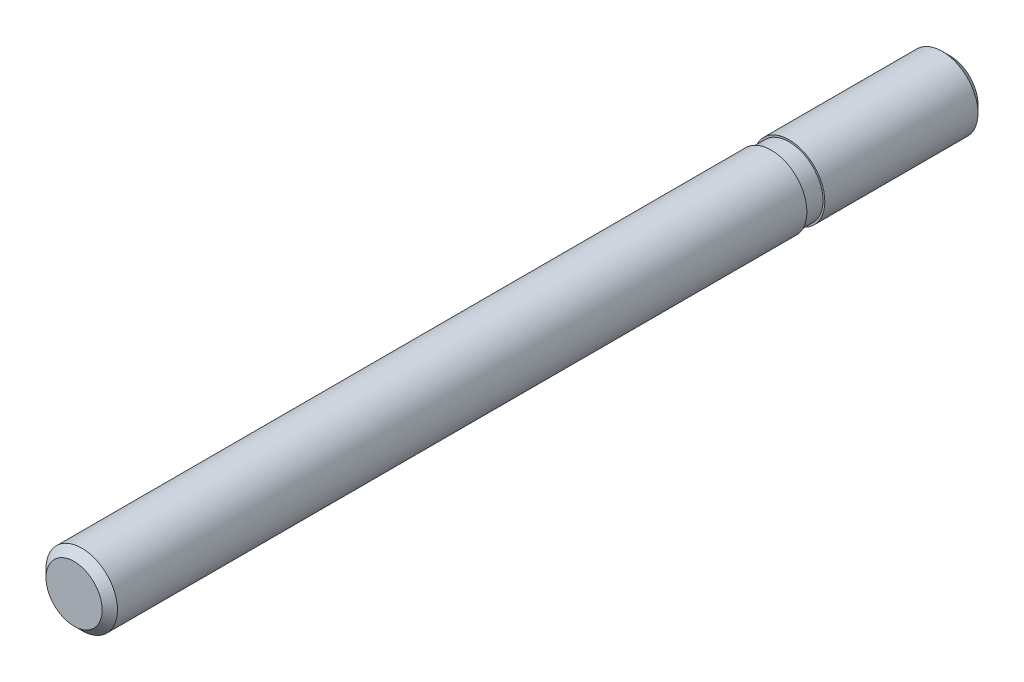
ISO-10303-21;
HEADER;
FILE_DESCRIPTION(('STEP AP214'),'2;1');
FILE_NAME('part.step','',(''),(''),'','','');
FILE_SCHEMA(('AUTOMOTIVE_DESIGN { 1 0 10303 214 1 1 1 1 }'));
ENDSEC;
DATA;
#1=APPLICATION_CONTEXT('core data for automotive mechanical design processes');
#2=APPLICATION_PROTOCOL_DEFINITION('international standard','automotive_design',2000,#1);
#3=PRODUCT_CONTEXT('',#1,'mechanical');
#4=PRODUCT('Part','Part','',(#3));
#5=PRODUCT_RELATED_PRODUCT_CATEGORY('part','',(#4));
#6=PRODUCT_DEFINITION_FORMATION('','',#4);
#7=PRODUCT_DEFINITION_CONTEXT('part definition',#1,'design');
#8=PRODUCT_DEFINITION('design','',#6,#7);
#9=PRODUCT_DEFINITION_SHAPE('','',#8);
#10=(LENGTH_UNIT() NAMED_UNIT(*) SI_UNIT(.MILLI.,.METRE.));
#11=(NAMED_UNIT(*) PLANE_ANGLE_UNIT() SI_UNIT($,.RADIAN.));
#12=(NAMED_UNIT(*) SI_UNIT($,.STERADIAN.) SOLID_ANGLE_UNIT());
#13=UNCERTAINTY_MEASURE_WITH_UNIT(LENGTH_MEASURE(1.E-05),#10,'distance_accuracy_value','');
#14=(GEOMETRIC_REPRESENTATION_CONTEXT(3) GLOBAL_UNCERTAINTY_ASSIGNED_CONTEXT((#13)) GLOBAL_UNIT_ASSIGNED_CONTEXT((#10,
#11,#12)) REPRESENTATION_CONTEXT('',''));
#15=CARTESIAN_POINT('',(0.,0.,0.));
#16=DIRECTION('',(0.,0.,1.));
#17=DIRECTION('',(1.,0.,0.));
#18=AXIS2_PLACEMENT_3D('',#15,#16,#17);
#19=CARTESIAN_POINT('',(0.,0.,7.5));
#20=DIRECTION('',(0.,0.,1.));
#21=DIRECTION('',(1.,0.,0.));
#22=AXIS2_PLACEMENT_3D('',#19,#20,#21);
#23=CYLINDRICAL_SURFACE('',#22,2.);
#24=CARTESIAN_POINT('',(0.,0.,0.));
#25=DIRECTION('',(0.,0.,1.));
#26=DIRECTION('',(1.,0.,0.));
#27=AXIS2_PLACEMENT_3D('',#24,#25,#26);
#28=CIRCLE('',#27,2.);
#29=CARTESIAN_POINT('',(2.,0.,0.));
#30=VERTEX_POINT('',#29);
#31=EDGE_CURVE('E19',#30,#30,#28,.T.);
#32=ORIENTED_EDGE('',*,*,#31,.F.);
#33=EDGE_LOOP('',(#32));
#34=FACE_BOUND('',#33,.T.);
#35=CARTESIAN_POINT('',(0.,0.,-8.5705));
#36=DIRECTION('',(0.,0.,1.));
#37=DIRECTION('',(1.,0.,0.));
#38=AXIS2_PLACEMENT_3D('',#35,#36,#37);
#39=CIRCLE('',#38,2.);
#40=CARTESIAN_POINT('',(2.,0.,-8.5705));
#41=VERTEX_POINT('',#40);
#42=EDGE_CURVE('E33',#41,#41,#39,.T.);
#43=ORIENTED_EDGE('',*,*,#42,.T.);
#44=EDGE_LOOP('',(#43));
#45=FACE_BOUND('',#44,.T.);
#46=ADVANCED_FACE('F12',(#34,#45),#23,.T.);
#47=CARTESIAN_POINT('',(0.,0.,0.));
#48=DIRECTION('',(0.,0.,1.));
#49=DIRECTION('',(1.,0.,0.));
#50=AXIS2_PLACEMENT_3D('',#47,#48,#49);
#51=PLANE('',#50);
#52=CARTESIAN_POINT('',(0.,0.,0.));
#53=DIRECTION('',(0.,0.,1.));
#54=DIRECTION('',(1.,0.,0.));
#55=AXIS2_PLACEMENT_3D('',#52,#53,#54);
#56=CIRCLE('',#55,1.9);
#57=CARTESIAN_POINT('',(1.9,0.,0.));
#58=VERTEX_POINT('',#57);
#59=EDGE_CURVE('E8',#58,#58,#56,.T.);
#60=ORIENTED_EDGE('',*,*,#59,.F.);
#61=EDGE_LOOP('',(#60));
#62=FACE_BOUND('',#61,.T.);
#63=ORIENTED_EDGE('',*,*,#31,.T.);
#64=EDGE_LOOP('',(#63));
#65=FACE_BOUND('',#64,.T.);
#66=ADVANCED_FACE('F69',(#62,#65),#51,.T.);
#67=CARTESIAN_POINT('',(0.,0.78525,-9.));
#68=DIRECTION('',(0.,0.,-1.));
#69=DIRECTION('',(-1.,0.,0.));
#70=AXIS2_PLACEMENT_3D('',#67,#68,#69);
#71=PLANE('',#70);
#72=CARTESIAN_POINT('',(0.,0.,-8.99999999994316));
#73=DIRECTION('',(0.,0.,1.));
#74=DIRECTION('',(1.,0.,0.));
#75=AXIS2_PLACEMENT_3D('',#72,#73,#74);
#76=CIRCLE('',#75,1.57050000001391);
#77=CARTESIAN_POINT('',(1.57050000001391,0.,-8.99999999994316));
#78=VERTEX_POINT('',#77);
#79=EDGE_CURVE('E36',#78,#78,#76,.T.);
#80=ORIENTED_EDGE('',*,*,#79,.F.);
#81=EDGE_LOOP('',(#80));
#82=FACE_BOUND('',#81,.T.);
#83=ADVANCED_FACE('F71',(#82),#71,.T.);
#84=CARTESIAN_POINT('',(0.,0.,-8.5705000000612));
#85=DIRECTION('',(0.,0.,1.));
#86=DIRECTION('',(1.,0.,0.));
#87=AXIS2_PLACEMENT_3D('',#84,#85,#86);
#88=CONICAL_SURFACE('',#87,1.9999999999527,0.785398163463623);
#89=ORIENTED_EDGE('',*,*,#42,.F.);
#90=EDGE_LOOP('',(#89));
#91=FACE_BOUND('',#90,.T.);
#92=ORIENTED_EDGE('',*,*,#79,.T.);
#93=EDGE_LOOP('',(#92));
#94=FACE_BOUND('',#93,.T.);
#95=ADVANCED_FACE('F79',(#91,#94),#88,.T.);
#96=CARTESIAN_POINT('',(0.,0.,-1.82228093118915));
#97=DIRECTION('',(0.,0.,-1.));
#98=DIRECTION('',(-1.,0.,0.));
#99=AXIS2_PLACEMENT_3D('',#96,#97,#98);
#100=CYLINDRICAL_SURFACE('',#99,1.9);
#101=CARTESIAN_POINT('',(0.,0.,1.));
#102=DIRECTION('',(0.,0.,-1.));
#103=DIRECTION('',(-1.,0.,0.));
#104=AXIS2_PLACEMENT_3D('',#101,#102,#103);
#105=CIRCLE('',#104,1.9);
#106=CARTESIAN_POINT('',(-1.9,0.,1.));
#107=VERTEX_POINT('',#106);
#108=EDGE_CURVE('E39',#107,#107,#105,.T.);
#109=ORIENTED_EDGE('',*,*,#108,.T.);
#110=EDGE_LOOP('',(#109));
#111=FACE_BOUND('',#110,.T.);
#112=ORIENTED_EDGE('',*,*,#59,.T.);
#113=EDGE_LOOP('',(#112));
#114=FACE_BOUND('',#113,.T.);
#115=ADVANCED_FACE('F45',(#111,#114),#100,.T.);
#116=CARTESIAN_POINT('',(0.,0.78525,40.));
#117=DIRECTION('',(0.,0.,1.));
#118=DIRECTION('',(1.,0.,0.));
#119=AXIS2_PLACEMENT_3D('',#116,#117,#118);
#120=PLANE('',#119);
#121=CARTESIAN_POINT('',(0.,0.,39.99999999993));
#122=DIRECTION('',(0.,0.,-1.));
#123=DIRECTION('',(-1.,0.,0.));
#124=AXIS2_PLACEMENT_3D('',#121,#122,#123);
#125=CIRCLE('',#124,1.57050000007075);
#126=CARTESIAN_POINT('',(-1.57050000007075,0.,39.99999999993));
#127=VERTEX_POINT('',#126);
#128=EDGE_CURVE('E30',#127,#127,#125,.T.);
#129=ORIENTED_EDGE('',*,*,#128,.F.);
#130=EDGE_LOOP('',(#129));
#131=FACE_BOUND('',#130,.T.);
#132=ADVANCED_FACE('F59',(#131),#120,.T.);
#133=CARTESIAN_POINT('',(0.,0.,39.5705000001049));
#134=DIRECTION('',(0.,0.,-1.));
#135=DIRECTION('',(-1.,0.,0.));
#136=AXIS2_PLACEMENT_3D('',#133,#134,#135);
#137=CONICAL_SURFACE('',#136,1.9999999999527,0.785398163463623);
#138=ORIENTED_EDGE('',*,*,#128,.T.);
#139=EDGE_LOOP('',(#138));
#140=FACE_BOUND('',#139,.T.);
#141=CARTESIAN_POINT('',(0.,0.,39.5705));
#142=DIRECTION('',(0.,0.,1.));
#143=DIRECTION('',(1.,0.,0.));
#144=AXIS2_PLACEMENT_3D('',#141,#142,#143);
#145=CIRCLE('',#144,2.);
#146=CARTESIAN_POINT('',(2.,0.,39.5705));
#147=VERTEX_POINT('',#146);
#148=EDGE_CURVE('E28',#147,#147,#145,.F.);
#149=ORIENTED_EDGE('',*,*,#148,.F.);
#150=EDGE_LOOP('',(#149));
#151=FACE_BOUND('',#150,.T.);
#152=ADVANCED_FACE('F55',(#140,#151),#137,.T.);
#153=CARTESIAN_POINT('',(0.,0.,7.5));
#154=DIRECTION('',(0.,0.,1.));
#155=DIRECTION('',(1.,0.,0.));
#156=AXIS2_PLACEMENT_3D('',#153,#154,#155);
#157=CYLINDRICAL_SURFACE('',#156,2.);
#158=CARTESIAN_POINT('',(0.,0.,1.));
#159=DIRECTION('',(0.,0.,1.));
#160=DIRECTION('',(1.,0.,0.));
#161=AXIS2_PLACEMENT_3D('',#158,#159,#160);
#162=CIRCLE('',#161,2.);
#163=CARTESIAN_POINT('',(2.,0.,1.));
#164=VERTEX_POINT('',#163);
#165=EDGE_CURVE('E23',#164,#164,#162,.T.);
#166=ORIENTED_EDGE('',*,*,#165,.T.);
#167=EDGE_LOOP('',(#166));
#168=FACE_BOUND('',#167,.T.);
#169=ORIENTED_EDGE('',*,*,#148,.T.);
#170=EDGE_LOOP('',(#169));
#171=FACE_BOUND('',#170,.T.);
#172=ADVANCED_FACE('F14',(#168,#171),#157,.T.);
#173=CARTESIAN_POINT('',(0.,0.,1.));
#174=DIRECTION('',(0.,0.,1.));
#175=DIRECTION('',(1.,0.,0.));
#176=AXIS2_PLACEMENT_3D('',#173,#174,#175);
#177=PLANE('',#176);
#178=ORIENTED_EDGE('',*,*,#108,.F.);
#179=EDGE_LOOP('',(#178));
#180=FACE_BOUND('',#179,.T.);
#181=ORIENTED_EDGE('',*,*,#165,.F.);
#182=EDGE_LOOP('',(#181));
#183=FACE_BOUND('',#182,.T.);
#184=ADVANCED_FACE('F47',(#180,#183),#177,.F.);
#185=CLOSED_SHELL('',(#46,#66,#83,#95,#115,#132,#152,#172,#184));
#186=MANIFOLD_SOLID_BREP('B1',#185);
#187=ADVANCED_BREP_SHAPE_REPRESENTATION('',(#18,#186),#14);
#188=SHAPE_DEFINITION_REPRESENTATION(#9,#187);
ENDSEC;
END-ISO-10303-21;
